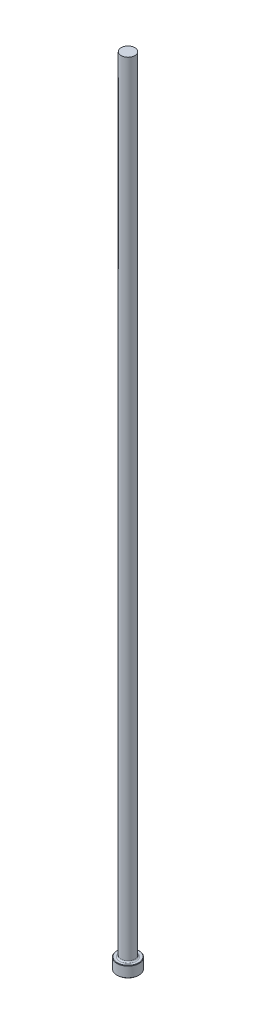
from build123d import *

# Parameters (mm, degrees)
CHAMFER1_SIZE = 0.254
FILLET1_R     = 0.762


with BuildPart() as part:
    # Sketch1 → Revolve1 (revolve)
    with BuildSketch(Plane.XY, mode=Mode.PRIVATE) as revolve1_sk:
        Polygon((0, 0), (-6.35, 0), (-6.35, 6.35), (-3.96875, 6.35), (-3.96875, 457.2), (0, 457.2), align=None)
    revolve(revolve1_sk.sketch.rotate(Axis((0, 259.958771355, 0), (0, -1, 0)), 270), axis=Axis((0, 259.958771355, 0), (0, -1, 0)))

    # Chamfer1
    chamfer1_edges = [part.edges().sort_by_distance(p)[0] for p in [
        (0, 6.35, -6.35),
        (0, 0, -6.35),
    ]]
    chamfer(chamfer1_edges, length=CHAMFER1_SIZE)

    # Fillet1
    fillet1_edges = [part.edges().sort_by_distance(p)[0] for p in [
        (0, 6.35, -3.96875),
    ]]
    fillet(fillet1_edges, radius=FILLET1_R)


solid = part.part
